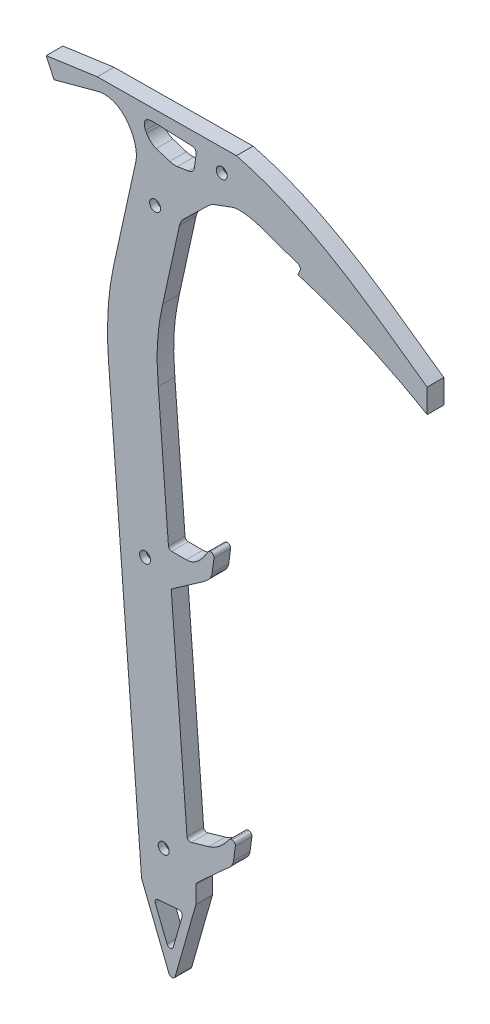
from build123d import *

# Parameters (mm, degrees)
BOSS_EXTRUDE1_DEPTH      = 12.7
FILLET1_R                = 2.54
CUT_EXTRUDE1_DEPTH       = 461.131533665
CUT_EXTRUDE1_DEPTH_BACK  = 461.131533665
BOSS_EXTRUDE2_DEPTH      = 12.7
FILLET2_R                = 12.7
SKETCH9_W                = 13.208
SKETCH9_H                = 13.208
CUT_EXTRUDE2_DEPTH       = 7.62
F_5_16_CLEARANCE_HOLE1_D = 8.4328


with BuildPart() as part:
    # Sketch2 → Boss-Extrude1 (new body)
    with BuildSketch(Plane.XY):
        with BuildLine():
            Line((-24.381519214, 54.99437995), (6.683618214, -350.216574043))
            Line((6.683618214, -350.216574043), (30.344648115, -409.633291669))
            Line((30.344648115, -409.633291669), (48.164661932, -347.036466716))
            Line((48.164661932, -347.036466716), (48.164661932, -332.698935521))
            Line((48.164661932, -332.698935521), (69.074652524, -313.547154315))
            add(Edge.make_bspline(
                [(76.966360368, -303.659842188), (76.35046024, -308.232220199), (72.184299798, -310.698980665), (69.074652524, -313.547154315)],
                knots=[0, 0, 0, 0, 1, 1, 1, 1], degree=3))
            Line((76.966360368, -303.659842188), (78.782448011, -290.177397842))
            Line((78.782448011, -290.177397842), (74.335791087, -290.177397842))
            add(Edge.make_bspline(
                [(74.335791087, -290.177397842), (66.934957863, -301.027986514), (58.01686648, -303.581901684)],
                knots=[0, 0, 0, 1, 1, 1], degree=2))
            Line((58.01686648, -303.581901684), (41.678906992, -308.26067888))
            Line((41.678906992, -308.26067888), (29.333329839, -147.226042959))
            Line((29.333329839, -147.226042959), (52.755727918, -130.901673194))
            add(Edge.make_bspline(
                [(60.647435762, -121.014361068), (60.031535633, -125.586739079), (56.215263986, -128.490530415), (52.755727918, -130.901673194)],
                knots=[0, 0, 0, 0, 1, 1, 1, 1], degree=3))
            Line((60.647435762, -121.014361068), (62.463523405, -107.531916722))
            Line((62.463523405, -107.531916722), (58.01686648, -107.531916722))
            add(Edge.make_bspline(
                [(58.01686648, -107.531916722), (50.196524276, -122.077096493), (40.919949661, -122.077096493)],
                knots=[0, 0, 0, 1, 1, 1], degree=2))
            Line((40.919949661, -122.077096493), (27.405308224, -122.077096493))
            Line((27.405308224, -122.077096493), (13.607007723, 57.906736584))
            add(Edge.make_bspline(
                [(17.032953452, 114.24896132), (11.964804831, 91.155831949), (12.168759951, 76.667115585), (13.607007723, 57.906736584)],
                knots=[0, 0, 0, 0, 1, 1, 1, 1], degree=3))
            Line((17.032953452, 114.24896132), (33.367484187, 188.677605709))
            add(Edge.make_bspline(
                [(33.367484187, 188.677605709), (33.899739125, 191.102836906), (36.146756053, 192.340586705), (38.192170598, 193.098192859)],
                knots=[0, 0, 0, 0, 1, 1, 1, 1], degree=3))
            Line((38.192170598, 193.098192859), (70.085762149, 204.911339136))
            add(Edge.make_bspline(
                [(70.085762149, 204.911339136), (74.268627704, 206.460641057), (83.723559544, 205.582408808), (90.006443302, 203.373136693)],
                knots=[0, 0, 0, 0, 1, 1, 1, 1], degree=3))
            Line((90.006443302, 203.373136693), (123.180174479, 191.708143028))
            Line((123.180174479, 191.708143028), (120.443490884, 185.463663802))
            add(Edge.make_bspline(
                [(219.315189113, 142.132499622), (171.677494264, 170.127728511), (120.443490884, 185.463663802)],
                knots=[0, 0, 0, 1, 1, 1], degree=2))
            Line((219.315189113, 142.132499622), (219.315189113, 160.422302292))
            add(Edge.make_bspline(
                [(219.315189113, 160.422302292), (171.735920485, 194.082892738), (130.178449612, 225.964616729), (73.415353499, 240.7485989)],
                knots=[0, 0, 0, 0, 1, 1, 1, 1], degree=3))
            Line((73.415353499, 240.7485989), (-33.000104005, 239.774233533))
            Line((-33.000104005, 239.774233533), (-72.087681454, 234.290783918))
            Line((-72.087681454, 234.290783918), (-66.119763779, 221.276409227))
            Line((-66.119763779, 221.276409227), (-33.000104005, 230.193837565))
            add(Edge.make_bspline(
                [(-33.000104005, 230.193837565), (-27.13666736, 231.772560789), (-14.986765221, 229.420511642), (-4.288211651, 214.563912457), (-2.529081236, 202.849258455), (-3.595864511, 197.988437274)],
                knots=[0, 0, 0, 0, 0.318927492, 0.707775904, 1, 1, 1, 1], degree=3))
            Line((-3.595864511, 197.988437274), (-20.611000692, 120.458599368))
            add(Edge.make_bspline(
                [(-24.381519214, 54.99437995), (-26.15460413, 78.122345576), (-25.103627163, 99.987849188), (-20.611000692, 120.458599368)],
                knots=[0, 0, 0, 0, 1, 1, 1, 1], degree=3))
        make_face()
        with BuildLine():
            Line((9.964083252, 231.351414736), (39.214695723, 230.193837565))
            add(Edge.make_bspline(
                [(39.214695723, 230.193837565), (41.861982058, 230.089072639), (42.833111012, 228.148273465), (42.601608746, 226.476312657)],
                knots=[0, 0, 0, 0, 1, 1, 1, 1], degree=3))
            Line((42.601608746, 226.476312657), (41.216053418, 216.46952418))
            add(Edge.make_bspline(
                [(36.546218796, 212.210224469), (39.435581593, 212.651197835), (40.927093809, 214.382593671), (41.216053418, 216.46952418)],
                knots=[0, 0, 0, 0, 1, 1, 1, 1], degree=3))
            Line((36.546218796, 212.210224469), (14.018115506, 208.771994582))
            add(Edge.make_bspline(
                [(10.323301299, 210.106233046), (10.912672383, 208.936920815), (12.145186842, 208.486148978), (14.018115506, 208.771994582)],
                knots=[0, 0, 0, 0, 1, 1, 1, 1], degree=3))
            Line((10.323301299, 210.106233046), (3.908693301, 222.832815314))
            add(Edge.make_bspline(
                [(3.908693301, 222.832815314), (2.340645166, 225.943822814), (1.853713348, 231.672378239), (9.964083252, 231.351414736)],
                knots=[0, 0, 0, 0, 1, 1, 1, 1], degree=3))
        make_face(mode=Mode.SUBTRACT)
        Polygon((15.906915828, -358.22479), (38.696088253, -356.477678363), (28.905993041, -390.867599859), align=None, mode=Mode.SUBTRACT)
    extrude(amount=BOSS_EXTRUDE1_DEPTH)

    # Fillet1
    fillet1_edges = [part.edges().sort_by_distance(p)[0] for p in [
        (123.180174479, 191.708143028, 6.35),
        (-33.000104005, 239.774233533, 6.35),
        (6.683618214, -350.216574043, 6.35),
        (30.344648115, -409.633291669, 6.35),
        (48.164661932, -347.036466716, 6.35),
        (48.164661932, -332.698935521, 6.35),
        (41.678906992, -308.26067888, 6.35),
        (74.335791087, -290.177397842, 6.35),
        (78.782448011, -290.177397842, 6.35),
        (27.405308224, -122.077096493, 6.35),
        (58.01686648, -107.531916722, 6.35),
        (62.463523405, -107.531916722, 6.35),
        (28.905993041, -390.867599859, 6.35),
        (15.906915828, -358.22479, 6.35),
        (38.696088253, -356.477678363, 6.35),
    ]]
    fillet(fillet1_edges, radius=FILLET1_R)

    # Sketch7 → Cut-Extrude1 (cut, two sides: drawn at the far end of the back side and taken through both)
    with BuildSketch(Plane.XY.offset(12.7).offset(-CUT_EXTRUDE1_DEPTH_BACK)):
        Polygon((-15.950987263, -54.972746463), (-21.77570053, 21.004307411), (16.212826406, 23.916664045), (22.037539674, -52.060389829), align=None)
    extrude(amount=CUT_EXTRUDE1_DEPTH + CUT_EXTRUDE1_DEPTH_BACK, mode=Mode.SUBTRACT)


with BuildPart() as cut_extrude1_piece_1:
    # of the separate pieces the step leaves, piece 1, a body of its own (cut_extrude1_pieces)
    add(part.part.solids().sort_by_distance((-24.381519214, 54.99437995, 0))[0])


with BuildPart() as cut_extrude1_piece_2:
    # of the separate pieces the step leaves, piece 2, a body of its own (cut_extrude1_pieces)
    add(part.part.solids().sort_by_distance((-15.950987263, -54.972746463, 0))[0])


with BuildPart() as cut_extrude1_piece_1_1:
    # Body-Move_Copy1: moved
    add(cut_extrude1_piece_1.part.moved(Location((5.824713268, -75.977053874, 0))))

    # Combine1: union Cut-Extrude1 piece 2
    add(cut_extrude1_piece_2.part)

    # Sketch8 → Boss-Extrude2 (add)
    with BuildSketch(Plane(origin=(0, 0, 0), x_dir=(-1, 0, 0), z_dir=(0, 0, -1))):
        with BuildLine():
            Line((-31.106880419, 134.514055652), (-12.940710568, 140.492470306))
            Line((-12.940710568, 140.492470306), (-16.148014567, 134.129179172))
            add(Edge.make_bspline(
                [(-16.148014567, 134.129179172), (-16.737385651, 132.959866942), (-17.96990011, 132.509095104), (-19.842828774, 132.794940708)],
                knots=[0, 0, 0, 0, 1, 1, 1, 1], degree=3))
            Line((-19.842828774, 132.794940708), (-31.106880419, 134.514055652))
        make_face()
        with BuildLine():
            Line((-59.963679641, 123.027712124), (-36.469775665, 100.295777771))
            Line((-36.469775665, 100.295777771), (-39.192197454, 112.700551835))
            add(Edge.make_bspline(
                [(-39.192197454, 112.700551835), (-39.724452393, 115.125783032), (-41.97146932, 116.363532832), (-44.016883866, 117.121138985)],
                knots=[0, 0, 0, 0, 1, 1, 1, 1], degree=3))
            Line((-44.016883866, 117.121138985), (-59.963679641, 123.027712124))
        make_face()
    extrude(amount=-BOSS_EXTRUDE2_DEPTH)

    # Fillet2
    fillet2_edges = [cut_extrude1_piece_1_1.edges().sort_by_distance(p)[0] for p in [
        (31.106880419, 134.514055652, 6.35),
        (12.940710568, 140.492470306, 6.35),
        (36.469775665, 100.295777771, 6.35),
        (59.963679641, 123.027712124, 6.35),
    ]]
    fillet(fillet2_edges, radius=FILLET2_R)

    # Sketch9 → Cut-Extrude2 (cut)
    with BuildSketch(Plane(origin=(0, 0, 0), x_dir=(-1, 0, 0), z_dir=(0, 0, -1))):
        Polygon((-15.461798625, -129.107919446), (-16.471415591, -142.277275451), (-3.302059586, -143.286892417), (-2.29244262, -130.117536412), align=None)
        Polygon((-30.701027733, -327.887100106), (-29.691410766, -314.717744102), (-16.522054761, -315.727361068), (-17.531671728, -328.896717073), align=None)
        Polygon((-22.076367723, 92.772045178), (-9.175402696, 95.603363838), (-12.006721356, 108.504328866), (-24.907686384, 105.673010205), align=None)
        with Locations((-68.009242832, 147.741681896)):
            Rectangle(SKETCH9_W, SKETCH9_H)
    extrude(amount=-CUT_EXTRUDE2_DEPTH, mode=Mode.SUBTRACT)

    # 5_16 Clearance Hole1 (through all)
    with Locations(Plane(origin=(0, 0, 0), x_dir=(-1, 0, 0), z_dir=(0, 0, -1))):
        with Locations((-68.009242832, 147.741681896), (-17.04154454, 100.638187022), (-9.381929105, -136.197405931), (-23.611541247, -321.807230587)):
            Hole(F_5_16_CLEARANCE_HOLE1_D / 2)


solid = cut_extrude1_piece_1_1.part
